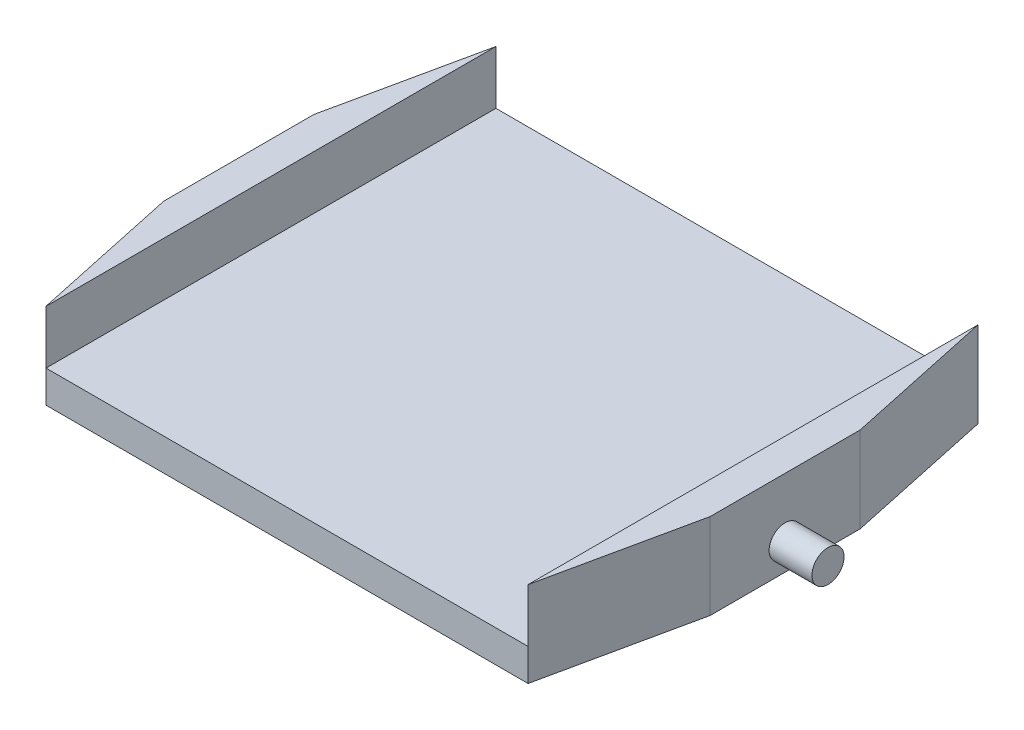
from build123d import *

# Parameters (mm, degrees)
BOSS_EXTRUDE1_DEPTH = 3
BOSS_EXTRUDE2_DEPTH = 5
SKETCH3_R           = 1.5
BOSS_EXTRUDE3_DEPTH = 4
BOSS_EXTRUDE4_START = 4
SKETCH4_R           = 1.5
BOSS_EXTRUDE4_DEPTH = 4


with BuildPart() as part:
    # Sketch1 → Boss-Extrude1 (new body)
    with BuildSketch(Plane(origin=(0, 0, 0), x_dir=(1, 0, 0), z_dir=(0, 1, 0))):
        Polygon((45, 0), (48, 14), (48, 28), (45, 42), (0, 42), (-3, 28), (-3, 14), (0, 0), align=None)
    extrude(amount=BOSS_EXTRUDE1_DEPTH)

    # Sketch2 → Boss-Extrude2 (add)
    with BuildSketch(Plane(origin=(0, 3, 0), x_dir=(1, 0, 0), z_dir=(0, 1, 0))):
        Polygon((0, 42), (0, 0), (-3, 14), (-3, 28), align=None)
        Polygon((45, 42), (45, 0), (48, 14), (48, 28), align=None)
    extrude(amount=BOSS_EXTRUDE2_DEPTH)

    # Sketch3 → Boss-Extrude3 (add)
    with BuildSketch(Plane.ZY.offset(3)):
        with Locations(Location((-21, 2.5, 0), (0, 0, 180))):
            Circle(SKETCH3_R)
    extrude(amount=BOSS_EXTRUDE3_DEPTH)

    # Sketch4 → Boss-Extrude4 (add)
    with BuildSketch(Plane(origin=(48, 0, 0), x_dir=(0, 0, -1), z_dir=(1, 0, 0)).offset(BOSS_EXTRUDE4_START)):
        with Locations((21, 2.5)):
            Circle(SKETCH4_R)
    extrude(amount=-BOSS_EXTRUDE4_DEPTH)


solid = part.part
